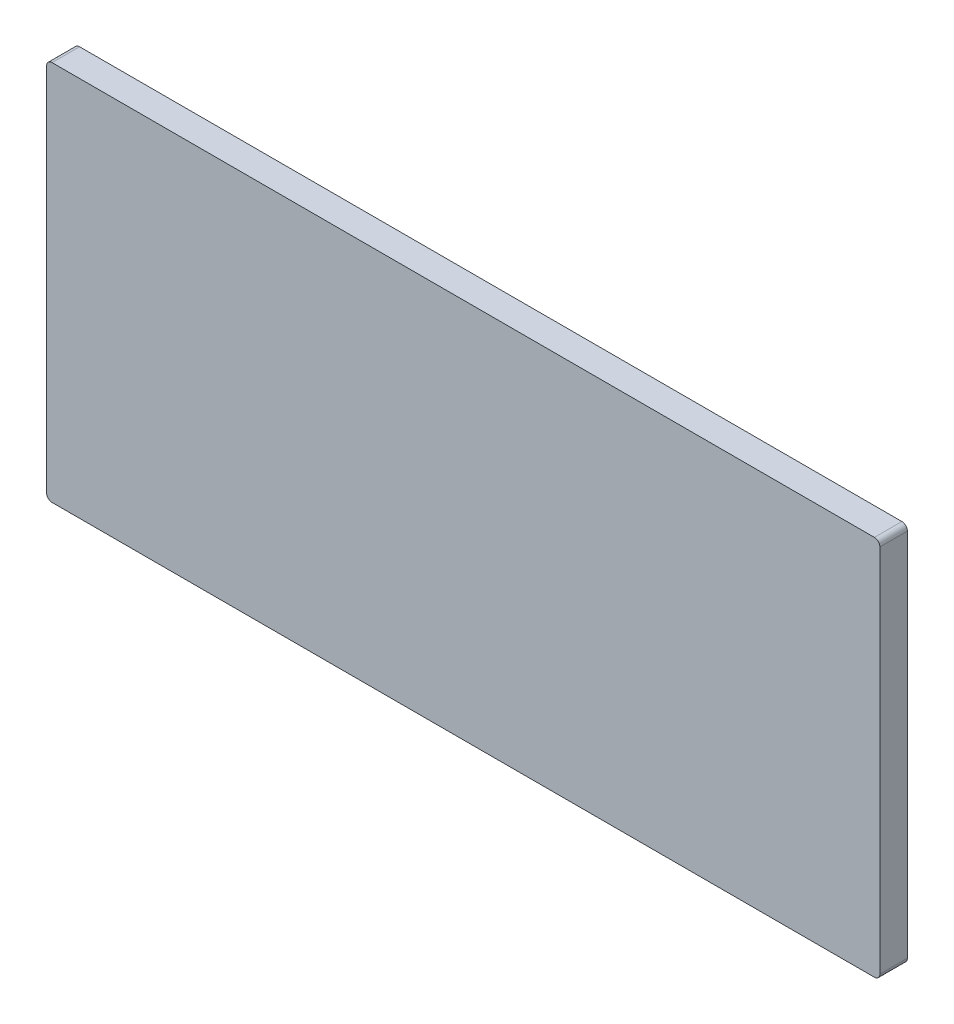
ISO-10303-21;
HEADER;
FILE_DESCRIPTION(('STEP AP214'),'2;1');
FILE_NAME('part.step','',(''),(''),'','','');
FILE_SCHEMA(('AUTOMOTIVE_DESIGN { 1 0 10303 214 1 1 1 1 }'));
ENDSEC;
DATA;
#1=APPLICATION_CONTEXT('core data for automotive mechanical design processes');
#2=APPLICATION_PROTOCOL_DEFINITION('international standard','automotive_design',2000,#1);
#3=PRODUCT_CONTEXT('',#1,'mechanical');
#4=PRODUCT('Part','Part','',(#3));
#5=PRODUCT_RELATED_PRODUCT_CATEGORY('part','',(#4));
#6=PRODUCT_DEFINITION_FORMATION('','',#4);
#7=PRODUCT_DEFINITION_CONTEXT('part definition',#1,'design');
#8=PRODUCT_DEFINITION('design','',#6,#7);
#9=PRODUCT_DEFINITION_SHAPE('','',#8);
#10=(LENGTH_UNIT() NAMED_UNIT(*) SI_UNIT(.MILLI.,.METRE.));
#11=(NAMED_UNIT(*) PLANE_ANGLE_UNIT() SI_UNIT($,.RADIAN.));
#12=(NAMED_UNIT(*) SI_UNIT($,.STERADIAN.) SOLID_ANGLE_UNIT());
#13=UNCERTAINTY_MEASURE_WITH_UNIT(LENGTH_MEASURE(1.E-05),#10,'distance_accuracy_value','');
#14=(GEOMETRIC_REPRESENTATION_CONTEXT(3) GLOBAL_UNCERTAINTY_ASSIGNED_CONTEXT((#13)) GLOBAL_UNIT_ASSIGNED_CONTEXT((#10,
#11,#12)) REPRESENTATION_CONTEXT('',''));
#15=CARTESIAN_POINT('',(0.,0.,0.));
#16=DIRECTION('',(0.,0.,1.));
#17=DIRECTION('',(1.,0.,0.));
#18=AXIS2_PLACEMENT_3D('',#15,#16,#17);
#19=CARTESIAN_POINT('',(-62.3927437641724,-38.9222222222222,10.));
#20=DIRECTION('',(0.,0.,-1.));
#21=DIRECTION('',(-1.,0.,0.));
#22=AXIS2_PLACEMENT_3D('',#19,#20,#21);
#23=CYLINDRICAL_SURFACE('',#22,2.);
#24=CARTESIAN_POINT('',(-62.3927437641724,-38.9222222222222,0.));
#25=DIRECTION('',(0.,0.,1.));
#26=DIRECTION('',(1.,0.,0.));
#27=AXIS2_PLACEMENT_3D('',#24,#25,#26);
#28=CIRCLE('',#27,2.);
#29=CARTESIAN_POINT('',(-64.3927437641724,-38.9222222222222,0.));
#30=VERTEX_POINT('',#29);
#31=CARTESIAN_POINT('',(-62.3927437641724,-40.9222222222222,0.));
#32=VERTEX_POINT('',#31);
#33=EDGE_CURVE('E130',#30,#32,#28,.T.);
#34=ORIENTED_EDGE('',*,*,#33,.T.);
#35=DIRECTION('',(0.,0.,-1.));
#36=VECTOR('',#35,1.);
#37=CARTESIAN_POINT('',(-62.3927437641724,-40.9222222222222,10.));
#38=LINE('',#37,#36);
#39=CARTESIAN_POINT('',(-62.3927437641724,-40.9222222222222,10.));
#40=VERTEX_POINT('',#39);
#41=EDGE_CURVE('E11',#40,#32,#38,.T.);
#42=ORIENTED_EDGE('',*,*,#41,.F.);
#43=CARTESIAN_POINT('',(-62.3927437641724,-38.9222222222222,10.));
#44=DIRECTION('',(0.,0.,1.));
#45=DIRECTION('',(1.,0.,0.));
#46=AXIS2_PLACEMENT_3D('',#43,#44,#45);
#47=CIRCLE('',#46,2.);
#48=CARTESIAN_POINT('',(-64.3927437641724,-38.9222222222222,10.));
#49=VERTEX_POINT('',#48);
#50=EDGE_CURVE('E144',#49,#40,#47,.T.);
#51=ORIENTED_EDGE('',*,*,#50,.F.);
#52=DIRECTION('',(0.,0.,-1.));
#53=VECTOR('',#52,1.);
#54=CARTESIAN_POINT('',(-64.3927437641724,-38.9222222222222,10.));
#55=LINE('',#54,#53);
#56=EDGE_CURVE('E126',#49,#30,#55,.T.);
#57=ORIENTED_EDGE('',*,*,#56,.T.);
#58=EDGE_LOOP('',(#34,#42,#51,#57));
#59=FACE_BOUND('',#58,.T.);
#60=ADVANCED_FACE('F34',(#59),#23,.T.);
#61=CARTESIAN_POINT('',(-62.3927437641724,-40.9222222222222,10.));
#62=DIRECTION('',(0.,1.,0.));
#63=DIRECTION('',(0.,0.,1.));
#64=AXIS2_PLACEMENT_3D('',#61,#62,#63);
#65=PLANE('',#64);
#66=DIRECTION('',(1.,0.,0.));
#67=VECTOR('',#66,1.);
#68=CARTESIAN_POINT('',(-62.3927437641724,-40.9222222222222,0.));
#69=LINE('',#68,#67);
#70=CARTESIAN_POINT('',(236.607256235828,-40.9222222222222,0.));
#71=VERTEX_POINT('',#70);
#72=EDGE_CURVE('E133',#32,#71,#69,.T.);
#73=ORIENTED_EDGE('',*,*,#72,.T.);
#74=DIRECTION('',(0.,0.,-1.));
#75=VECTOR('',#74,1.);
#76=CARTESIAN_POINT('',(236.607256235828,-40.9222222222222,10.));
#77=LINE('',#76,#75);
#78=CARTESIAN_POINT('',(236.607256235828,-40.9222222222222,10.));
#79=VERTEX_POINT('',#78);
#80=EDGE_CURVE('E42',#79,#71,#77,.T.);
#81=ORIENTED_EDGE('',*,*,#80,.F.);
#82=DIRECTION('',(1.,0.,0.));
#83=VECTOR('',#82,1.);
#84=CARTESIAN_POINT('',(-62.3927437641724,-40.9222222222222,10.));
#85=LINE('',#84,#83);
#86=EDGE_CURVE('E93',#40,#79,#85,.T.);
#87=ORIENTED_EDGE('',*,*,#86,.F.);
#88=ORIENTED_EDGE('',*,*,#41,.T.);
#89=EDGE_LOOP('',(#73,#81,#87,#88));
#90=FACE_BOUND('',#89,.T.);
#91=ADVANCED_FACE('F179',(#90),#65,.F.);
#92=CARTESIAN_POINT('',(236.607256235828,-38.9222222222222,10.));
#93=DIRECTION('',(0.,0.,-1.));
#94=DIRECTION('',(-1.,0.,0.));
#95=AXIS2_PLACEMENT_3D('',#92,#93,#94);
#96=CYLINDRICAL_SURFACE('',#95,2.);
#97=CARTESIAN_POINT('',(236.607256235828,-38.9222222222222,0.));
#98=DIRECTION('',(0.,0.,1.));
#99=DIRECTION('',(1.,0.,0.));
#100=AXIS2_PLACEMENT_3D('',#97,#98,#99);
#101=CIRCLE('',#100,2.);
#102=CARTESIAN_POINT('',(238.607256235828,-38.9222222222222,0.));
#103=VERTEX_POINT('',#102);
#104=EDGE_CURVE('E135',#71,#103,#101,.T.);
#105=ORIENTED_EDGE('',*,*,#104,.T.);
#106=DIRECTION('',(0.,0.,-1.));
#107=VECTOR('',#106,1.);
#108=CARTESIAN_POINT('',(238.607256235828,-38.9222222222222,10.));
#109=LINE('',#108,#107);
#110=CARTESIAN_POINT('',(238.607256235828,-38.9222222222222,10.));
#111=VERTEX_POINT('',#110);
#112=EDGE_CURVE('E151',#111,#103,#109,.T.);
#113=ORIENTED_EDGE('',*,*,#112,.F.);
#114=CARTESIAN_POINT('',(236.607256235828,-38.9222222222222,10.));
#115=DIRECTION('',(0.,0.,1.));
#116=DIRECTION('',(1.,0.,0.));
#117=AXIS2_PLACEMENT_3D('',#114,#115,#116);
#118=CIRCLE('',#117,2.);
#119=EDGE_CURVE('E159',#79,#111,#118,.T.);
#120=ORIENTED_EDGE('',*,*,#119,.F.);
#121=ORIENTED_EDGE('',*,*,#80,.T.);
#122=EDGE_LOOP('',(#105,#113,#120,#121));
#123=FACE_BOUND('',#122,.T.);
#124=ADVANCED_FACE('F157',(#123),#96,.T.);
#125=CARTESIAN_POINT('',(238.607256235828,95.5777777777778,10.));
#126=DIRECTION('',(-1.,0.,0.));
#127=DIRECTION('',(0.,0.,1.));
#128=AXIS2_PLACEMENT_3D('',#125,#126,#127);
#129=PLANE('',#128);
#130=DIRECTION('',(0.,1.,0.));
#131=VECTOR('',#130,1.);
#132=CARTESIAN_POINT('',(238.607256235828,95.5777777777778,0.));
#133=LINE('',#132,#131);
#134=CARTESIAN_POINT('',(238.607256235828,95.5777777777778,0.));
#135=VERTEX_POINT('',#134);
#136=EDGE_CURVE('E137',#103,#135,#133,.T.);
#137=ORIENTED_EDGE('',*,*,#136,.T.);
#138=DIRECTION('',(0.,0.,-1.));
#139=VECTOR('',#138,1.);
#140=CARTESIAN_POINT('',(238.607256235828,95.5777777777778,10.));
#141=LINE('',#140,#139);
#142=CARTESIAN_POINT('',(238.607256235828,95.5777777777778,10.));
#143=VERTEX_POINT('',#142);
#144=EDGE_CURVE('E148',#143,#135,#141,.T.);
#145=ORIENTED_EDGE('',*,*,#144,.F.);
#146=DIRECTION('',(0.,1.,0.));
#147=VECTOR('',#146,1.);
#148=CARTESIAN_POINT('',(238.607256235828,95.5777777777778,10.));
#149=LINE('',#148,#147);
#150=EDGE_CURVE('E171',#111,#143,#149,.T.);
#151=ORIENTED_EDGE('',*,*,#150,.F.);
#152=ORIENTED_EDGE('',*,*,#112,.T.);
#153=EDGE_LOOP('',(#137,#145,#151,#152));
#154=FACE_BOUND('',#153,.T.);
#155=ADVANCED_FACE('F167',(#154),#129,.F.);
#156=CARTESIAN_POINT('',(236.607256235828,95.5777777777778,10.));
#157=DIRECTION('',(0.,0.,-1.));
#158=DIRECTION('',(-1.,0.,0.));
#159=AXIS2_PLACEMENT_3D('',#156,#157,#158);
#160=CYLINDRICAL_SURFACE('',#159,2.);
#161=CARTESIAN_POINT('',(236.607256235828,95.5777777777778,0.));
#162=DIRECTION('',(0.,0.,1.));
#163=DIRECTION('',(-1.,0.,0.));
#164=AXIS2_PLACEMENT_3D('',#161,#162,#163);
#165=CIRCLE('',#164,2.);
#166=CARTESIAN_POINT('',(236.607256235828,97.5777777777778,0.));
#167=VERTEX_POINT('',#166);
#168=EDGE_CURVE('E139',#135,#167,#165,.T.);
#169=ORIENTED_EDGE('',*,*,#168,.T.);
#170=DIRECTION('',(0.,0.,-1.));
#171=VECTOR('',#170,1.);
#172=CARTESIAN_POINT('',(236.607256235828,97.5777777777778,10.));
#173=LINE('',#172,#171);
#174=CARTESIAN_POINT('',(236.607256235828,97.5777777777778,10.));
#175=VERTEX_POINT('',#174);
#176=EDGE_CURVE('E121',#175,#167,#173,.T.);
#177=ORIENTED_EDGE('',*,*,#176,.F.);
#178=CARTESIAN_POINT('',(236.607256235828,95.5777777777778,10.));
#179=DIRECTION('',(0.,0.,1.));
#180=DIRECTION('',(-1.,0.,0.));
#181=AXIS2_PLACEMENT_3D('',#178,#179,#180);
#182=CIRCLE('',#181,2.);
#183=EDGE_CURVE('E112',#143,#175,#182,.T.);
#184=ORIENTED_EDGE('',*,*,#183,.F.);
#185=ORIENTED_EDGE('',*,*,#144,.T.);
#186=EDGE_LOOP('',(#169,#177,#184,#185));
#187=FACE_BOUND('',#186,.T.);
#188=ADVANCED_FACE('F170',(#187),#160,.T.);
#189=CARTESIAN_POINT('',(-62.3927437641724,97.5777777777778,10.));
#190=DIRECTION('',(0.,-1.,0.));
#191=DIRECTION('',(0.,0.,-1.));
#192=AXIS2_PLACEMENT_3D('',#189,#190,#191);
#193=PLANE('',#192);
#194=DIRECTION('',(-1.,0.,0.));
#195=VECTOR('',#194,1.);
#196=CARTESIAN_POINT('',(-62.3927437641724,97.5777777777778,0.));
#197=LINE('',#196,#195);
#198=CARTESIAN_POINT('',(-62.3927437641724,97.5777777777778,0.));
#199=VERTEX_POINT('',#198);
#200=EDGE_CURVE('E120',#167,#199,#197,.T.);
#201=ORIENTED_EDGE('',*,*,#200,.T.);
#202=DIRECTION('',(0.,0.,-1.));
#203=VECTOR('',#202,1.);
#204=CARTESIAN_POINT('',(-62.3927437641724,97.5777777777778,10.));
#205=LINE('',#204,#203);
#206=CARTESIAN_POINT('',(-62.3927437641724,97.5777777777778,10.));
#207=VERTEX_POINT('',#206);
#208=EDGE_CURVE('E117',#207,#199,#205,.T.);
#209=ORIENTED_EDGE('',*,*,#208,.F.);
#210=DIRECTION('',(-1.,0.,0.));
#211=VECTOR('',#210,1.);
#212=CARTESIAN_POINT('',(-62.3927437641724,97.5777777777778,10.));
#213=LINE('',#212,#211);
#214=EDGE_CURVE('E106',#175,#207,#213,.T.);
#215=ORIENTED_EDGE('',*,*,#214,.F.);
#216=ORIENTED_EDGE('',*,*,#176,.T.);
#217=EDGE_LOOP('',(#201,#209,#215,#216));
#218=FACE_BOUND('',#217,.T.);
#219=ADVANCED_FACE('F118',(#218),#193,.F.);
#220=CARTESIAN_POINT('',(-62.3927437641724,95.5777777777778,10.));
#221=DIRECTION('',(0.,0.,-1.));
#222=DIRECTION('',(-1.,0.,0.));
#223=AXIS2_PLACEMENT_3D('',#220,#221,#222);
#224=CYLINDRICAL_SURFACE('',#223,2.);
#225=CARTESIAN_POINT('',(-62.3927437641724,95.5777777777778,0.));
#226=DIRECTION('',(0.,0.,1.));
#227=DIRECTION('',(1.,0.,0.));
#228=AXIS2_PLACEMENT_3D('',#225,#226,#227);
#229=CIRCLE('',#228,2.);
#230=CARTESIAN_POINT('',(-64.3927437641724,95.5777777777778,0.));
#231=VERTEX_POINT('',#230);
#232=EDGE_CURVE('E79',#199,#231,#229,.T.);
#233=ORIENTED_EDGE('',*,*,#232,.T.);
#234=DIRECTION('',(0.,0.,-1.));
#235=VECTOR('',#234,1.);
#236=CARTESIAN_POINT('',(-64.3927437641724,95.5777777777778,10.));
#237=LINE('',#236,#235);
#238=CARTESIAN_POINT('',(-64.3927437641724,95.5777777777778,10.));
#239=VERTEX_POINT('',#238);
#240=EDGE_CURVE('E122',#239,#231,#237,.T.);
#241=ORIENTED_EDGE('',*,*,#240,.F.);
#242=CARTESIAN_POINT('',(-62.3927437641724,95.5777777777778,10.));
#243=DIRECTION('',(0.,0.,1.));
#244=DIRECTION('',(1.,0.,0.));
#245=AXIS2_PLACEMENT_3D('',#242,#243,#244);
#246=CIRCLE('',#245,2.);
#247=EDGE_CURVE('E110',#207,#239,#246,.T.);
#248=ORIENTED_EDGE('',*,*,#247,.F.);
#249=ORIENTED_EDGE('',*,*,#208,.T.);
#250=EDGE_LOOP('',(#233,#241,#248,#249));
#251=FACE_BOUND('',#250,.T.);
#252=ADVANCED_FACE('F124',(#251),#224,.T.);
#253=CARTESIAN_POINT('',(-64.3927437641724,95.5777777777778,10.));
#254=DIRECTION('',(1.,0.,0.));
#255=DIRECTION('',(0.,1.,0.));
#256=AXIS2_PLACEMENT_3D('',#253,#254,#255);
#257=PLANE('',#256);
#258=DIRECTION('',(0.,-1.,0.));
#259=VECTOR('',#258,1.);
#260=CARTESIAN_POINT('',(-64.3927437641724,95.5777777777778,0.));
#261=LINE('',#260,#259);
#262=EDGE_CURVE('E85',#231,#30,#261,.T.);
#263=ORIENTED_EDGE('',*,*,#262,.T.);
#264=ORIENTED_EDGE('',*,*,#56,.F.);
#265=DIRECTION('',(0.,-1.,0.));
#266=VECTOR('',#265,1.);
#267=CARTESIAN_POINT('',(-64.3927437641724,95.5777777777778,10.));
#268=LINE('',#267,#266);
#269=EDGE_CURVE('E50',#239,#49,#268,.T.);
#270=ORIENTED_EDGE('',*,*,#269,.F.);
#271=ORIENTED_EDGE('',*,*,#240,.T.);
#272=EDGE_LOOP('',(#263,#264,#270,#271));
#273=FACE_BOUND('',#272,.T.);
#274=ADVANCED_FACE('F195',(#273),#257,.F.);
#275=CARTESIAN_POINT('',(-62.3927437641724,-38.9222222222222,10.));
#276=DIRECTION('',(0.,0.,1.));
#277=DIRECTION('',(1.,0.,0.));
#278=AXIS2_PLACEMENT_3D('',#275,#276,#277);
#279=PLANE('',#278);
#280=ORIENTED_EDGE('',*,*,#50,.T.);
#281=ORIENTED_EDGE('',*,*,#86,.T.);
#282=ORIENTED_EDGE('',*,*,#119,.T.);
#283=ORIENTED_EDGE('',*,*,#150,.T.);
#284=ORIENTED_EDGE('',*,*,#183,.T.);
#285=ORIENTED_EDGE('',*,*,#214,.T.);
#286=ORIENTED_EDGE('',*,*,#247,.T.);
#287=ORIENTED_EDGE('',*,*,#269,.T.);
#288=EDGE_LOOP('',(#280,#281,#282,#283,#284,#285,#286,#287));
#289=FACE_BOUND('',#288,.T.);
#290=ADVANCED_FACE('F108',(#289),#279,.T.);
#291=CARTESIAN_POINT('',(-62.3927437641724,-38.9222222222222,0.));
#292=DIRECTION('',(0.,0.,1.));
#293=DIRECTION('',(1.,0.,0.));
#294=AXIS2_PLACEMENT_3D('',#291,#292,#293);
#295=PLANE('',#294);
#296=ORIENTED_EDGE('',*,*,#33,.F.);
#297=ORIENTED_EDGE('',*,*,#262,.F.);
#298=ORIENTED_EDGE('',*,*,#232,.F.);
#299=ORIENTED_EDGE('',*,*,#200,.F.);
#300=ORIENTED_EDGE('',*,*,#168,.F.);
#301=ORIENTED_EDGE('',*,*,#136,.F.);
#302=ORIENTED_EDGE('',*,*,#104,.F.);
#303=ORIENTED_EDGE('',*,*,#72,.F.);
#304=EDGE_LOOP('',(#296,#297,#298,#299,#300,#301,#302,#303));
#305=FACE_BOUND('',#304,.T.);
#306=ADVANCED_FACE('F163',(#305),#295,.F.);
#307=CLOSED_SHELL('',(#60,#91,#124,#155,#188,#219,#252,#274,#290,#306));
#308=MANIFOLD_SOLID_BREP('B2',#307);
#309=ADVANCED_BREP_SHAPE_REPRESENTATION('',(#18,#308),#14);
#310=SHAPE_DEFINITION_REPRESENTATION(#9,#309);
ENDSEC;
END-ISO-10303-21;
